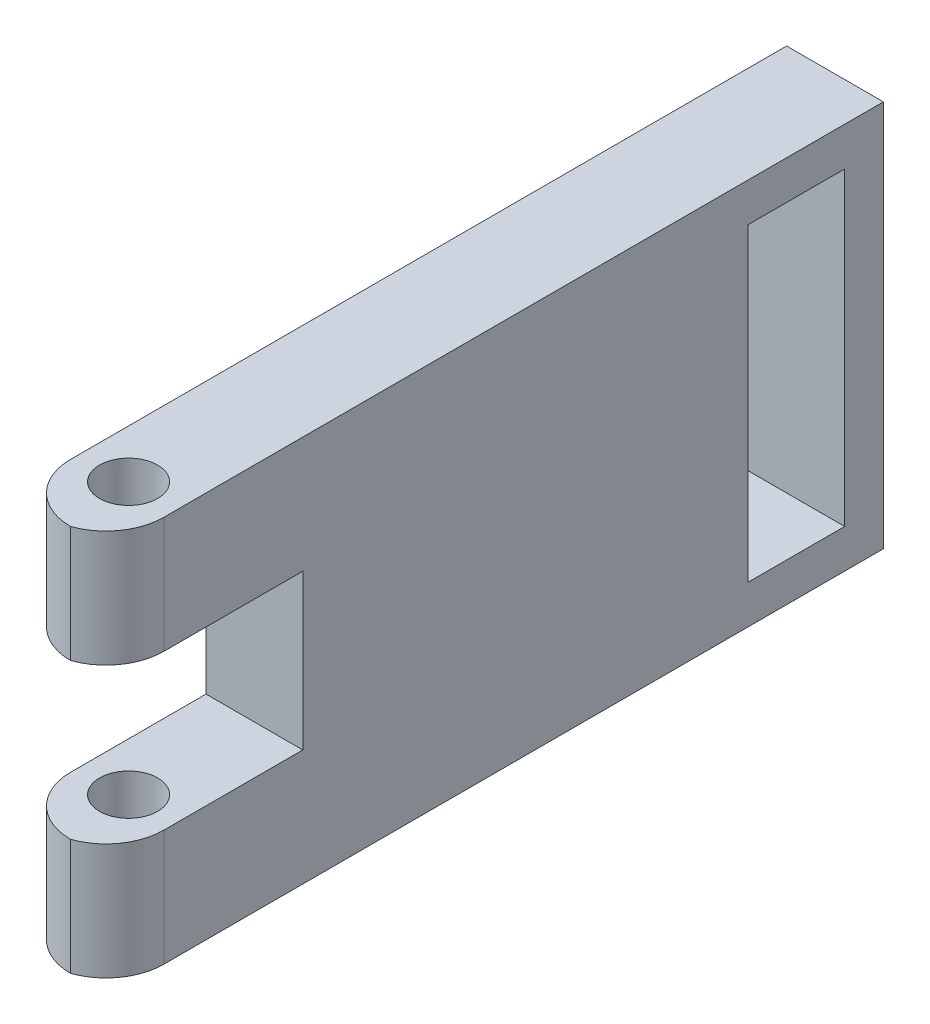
ISO-10303-21;
HEADER;
FILE_DESCRIPTION(('STEP AP214'),'2;1');
FILE_NAME('part.step','',(''),(''),'','','');
FILE_SCHEMA(('AUTOMOTIVE_DESIGN { 1 0 10303 214 1 1 1 1 }'));
ENDSEC;
DATA;
#1=APPLICATION_CONTEXT('core data for automotive mechanical design processes');
#2=APPLICATION_PROTOCOL_DEFINITION('international standard','automotive_design',2000,#1);
#3=PRODUCT_CONTEXT('',#1,'mechanical');
#4=PRODUCT('Part','Part','',(#3));
#5=PRODUCT_RELATED_PRODUCT_CATEGORY('part','',(#4));
#6=PRODUCT_DEFINITION_FORMATION('','',#4);
#7=PRODUCT_DEFINITION_CONTEXT('part definition',#1,'design');
#8=PRODUCT_DEFINITION('design','',#6,#7);
#9=PRODUCT_DEFINITION_SHAPE('','',#8);
#10=(LENGTH_UNIT() NAMED_UNIT(*) SI_UNIT(.MILLI.,.METRE.));
#11=(NAMED_UNIT(*) PLANE_ANGLE_UNIT() SI_UNIT($,.RADIAN.));
#12=(NAMED_UNIT(*) SI_UNIT($,.STERADIAN.) SOLID_ANGLE_UNIT());
#13=UNCERTAINTY_MEASURE_WITH_UNIT(LENGTH_MEASURE(1.E-05),#10,'distance_accuracy_value','');
#14=(GEOMETRIC_REPRESENTATION_CONTEXT(3) GLOBAL_UNCERTAINTY_ASSIGNED_CONTEXT((#13)) GLOBAL_UNIT_ASSIGNED_CONTEXT((#10,
#11,#12)) REPRESENTATION_CONTEXT('',''));
#15=CARTESIAN_POINT('',(0.,0.,0.));
#16=DIRECTION('',(0.,0.,1.));
#17=DIRECTION('',(1.,0.,0.));
#18=AXIS2_PLACEMENT_3D('',#15,#16,#17);
#19=CARTESIAN_POINT('',(5.,0.,0.));
#20=DIRECTION('',(0.,0.,-1.));
#21=DIRECTION('',(-1.,0.,0.));
#22=AXIS2_PLACEMENT_3D('',#19,#20,#21);
#23=PLANE('',#22);
#24=DIRECTION('',(1.,0.,0.));
#25=VECTOR('',#24,1.);
#26=CARTESIAN_POINT('',(0.,14.,0.));
#27=LINE('',#26,#25);
#28=CARTESIAN_POINT('',(0.,14.,0.));
#29=VERTEX_POINT('',#28);
#30=CARTESIAN_POINT('',(5.,14.,0.));
#31=VERTEX_POINT('',#30);
#32=EDGE_CURVE('E205',#29,#31,#27,.T.);
#33=ORIENTED_EDGE('',*,*,#32,.F.);
#34=DIRECTION('',(0.,-1.,0.));
#35=VECTOR('',#34,1.);
#36=CARTESIAN_POINT('',(0.,0.,0.));
#37=LINE('',#36,#35);
#38=CARTESIAN_POINT('',(0.,6.,0.));
#39=VERTEX_POINT('',#38);
#40=EDGE_CURVE('E225',#29,#39,#37,.T.);
#41=ORIENTED_EDGE('',*,*,#40,.T.);
#42=DIRECTION('',(-1.,0.,0.));
#43=VECTOR('',#42,1.);
#44=CARTESIAN_POINT('',(0.,6.,0.));
#45=LINE('',#44,#43);
#46=CARTESIAN_POINT('',(5.,6.,0.));
#47=VERTEX_POINT('',#46);
#48=EDGE_CURVE('E215',#47,#39,#45,.T.);
#49=ORIENTED_EDGE('',*,*,#48,.F.);
#50=DIRECTION('',(0.,-1.,0.));
#51=VECTOR('',#50,1.);
#52=CARTESIAN_POINT('',(5.,0.,0.));
#53=LINE('',#52,#51);
#54=EDGE_CURVE('E226',#31,#47,#53,.T.);
#55=ORIENTED_EDGE('',*,*,#54,.F.);
#56=EDGE_LOOP('',(#33,#41,#49,#55));
#57=FACE_BOUND('',#56,.T.);
#58=ADVANCED_FACE('F43',(#57),#23,.F.);
#59=CARTESIAN_POINT('',(5.,0.,0.));
#60=DIRECTION('',(0.,1.,0.));
#61=DIRECTION('',(0.,0.,1.));
#62=AXIS2_PLACEMENT_3D('',#59,#60,#61);
#63=PLANE('',#62);
#64=CARTESIAN_POINT('',(2.5,0.,6.5));
#65=DIRECTION('',(0.,1.,0.));
#66=DIRECTION('',(0.,0.,1.));
#67=AXIS2_PLACEMENT_3D('',#64,#65,#66);
#68=CIRCLE('',#67,1.5);
#69=CARTESIAN_POINT('',(2.5,0.,8.));
#70=VERTEX_POINT('',#69);
#71=EDGE_CURVE('E193',#70,#70,#68,.T.);
#72=ORIENTED_EDGE('',*,*,#71,.T.);
#73=EDGE_LOOP('',(#72));
#74=FACE_BOUND('',#73,.T.);
#75=DIRECTION('',(0.,0.,-1.));
#76=VECTOR('',#75,1.);
#77=CARTESIAN_POINT('',(5.,0.,0.));
#78=LINE('',#77,#76);
#79=CARTESIAN_POINT('',(5.,0.,7.17157287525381));
#80=VERTEX_POINT('',#79);
#81=CARTESIAN_POINT('',(5.,0.,-30.));
#82=VERTEX_POINT('',#81);
#83=EDGE_CURVE('E230',#80,#82,#78,.T.);
#84=ORIENTED_EDGE('',*,*,#83,.F.);
#85=CARTESIAN_POINT('',(2.,0.,7.17157287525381));
#86=DIRECTION('',(0.,1.,0.));
#87=DIRECTION('',(0.,0.,1.));
#88=AXIS2_PLACEMENT_3D('',#85,#86,#87);
#89=CIRCLE('',#88,3.);
#90=CARTESIAN_POINT('',(3.,0.,10.));
#91=VERTEX_POINT('',#90);
#92=EDGE_CURVE('E281',#80,#91,#89,.F.);
#93=ORIENTED_EDGE('',*,*,#92,.T.);
#94=CARTESIAN_POINT('',(3.,0.,7.));
#95=DIRECTION('',(0.,1.,0.));
#96=DIRECTION('',(0.,0.,1.));
#97=AXIS2_PLACEMENT_3D('',#94,#95,#96);
#98=CIRCLE('',#97,3.);
#99=CARTESIAN_POINT('',(0.,0.,7.));
#100=VERTEX_POINT('',#99);
#101=EDGE_CURVE('E265',#91,#100,#98,.F.);
#102=ORIENTED_EDGE('',*,*,#101,.T.);
#103=DIRECTION('',(0.,0.,-1.));
#104=VECTOR('',#103,1.);
#105=CARTESIAN_POINT('',(0.,0.,0.));
#106=LINE('',#105,#104);
#107=CARTESIAN_POINT('',(0.,0.,-30.));
#108=VERTEX_POINT('',#107);
#109=EDGE_CURVE('E245',#100,#108,#106,.T.);
#110=ORIENTED_EDGE('',*,*,#109,.T.);
#111=DIRECTION('',(-1.,0.,0.));
#112=VECTOR('',#111,1.);
#113=CARTESIAN_POINT('',(5.,0.,-30.));
#114=LINE('',#113,#112);
#115=EDGE_CURVE('E257',#82,#108,#114,.T.);
#116=ORIENTED_EDGE('',*,*,#115,.F.);
#117=EDGE_LOOP('',(#84,#93,#102,#110,#116));
#118=FACE_BOUND('',#117,.T.);
#119=ADVANCED_FACE('F343',(#74,#118),#63,.F.);
#120=CARTESIAN_POINT('',(5.,0.,-30.));
#121=DIRECTION('',(0.,0.,1.));
#122=DIRECTION('',(1.,0.,0.));
#123=AXIS2_PLACEMENT_3D('',#120,#121,#122);
#124=PLANE('',#123);
#125=DIRECTION('',(0.,1.,0.));
#126=VECTOR('',#125,1.);
#127=CARTESIAN_POINT('',(0.,0.,-30.));
#128=LINE('',#127,#126);
#129=CARTESIAN_POINT('',(0.,20.,-30.));
#130=VERTEX_POINT('',#129);
#131=EDGE_CURVE('E248',#108,#130,#128,.T.);
#132=ORIENTED_EDGE('',*,*,#131,.T.);
#133=DIRECTION('',(-1.,0.,0.));
#134=VECTOR('',#133,1.);
#135=CARTESIAN_POINT('',(5.,20.,-30.));
#136=LINE('',#135,#134);
#137=CARTESIAN_POINT('',(5.,20.,-30.));
#138=VERTEX_POINT('',#137);
#139=EDGE_CURVE('E241',#138,#130,#136,.T.);
#140=ORIENTED_EDGE('',*,*,#139,.F.);
#141=DIRECTION('',(0.,1.,0.));
#142=VECTOR('',#141,1.);
#143=CARTESIAN_POINT('',(5.,0.,-30.));
#144=LINE('',#143,#142);
#145=EDGE_CURVE('E234',#82,#138,#144,.T.);
#146=ORIENTED_EDGE('',*,*,#145,.F.);
#147=ORIENTED_EDGE('',*,*,#115,.T.);
#148=EDGE_LOOP('',(#132,#140,#146,#147));
#149=FACE_BOUND('',#148,.T.);
#150=ADVANCED_FACE('F325',(#149),#124,.F.);
#151=CARTESIAN_POINT('',(5.,20.,0.));
#152=DIRECTION('',(0.,-1.,0.));
#153=DIRECTION('',(0.,0.,-1.));
#154=AXIS2_PLACEMENT_3D('',#151,#152,#153);
#155=PLANE('',#154);
#156=CARTESIAN_POINT('',(2.5,20.,6.5));
#157=DIRECTION('',(0.,-1.,0.));
#158=DIRECTION('',(0.,0.,-1.));
#159=AXIS2_PLACEMENT_3D('',#156,#157,#158);
#160=CIRCLE('',#159,1.5);
#161=CARTESIAN_POINT('',(2.5,20.,5.));
#162=VERTEX_POINT('',#161);
#163=EDGE_CURVE('E201',#162,#162,#160,.T.);
#164=ORIENTED_EDGE('',*,*,#163,.T.);
#165=EDGE_LOOP('',(#164));
#166=FACE_BOUND('',#165,.T.);
#167=CARTESIAN_POINT('',(3.,20.,7.));
#168=DIRECTION('',(0.,-1.,0.));
#169=DIRECTION('',(0.,0.,-1.));
#170=AXIS2_PLACEMENT_3D('',#167,#168,#169);
#171=CIRCLE('',#170,3.);
#172=CARTESIAN_POINT('',(0.,20.,7.));
#173=VERTEX_POINT('',#172);
#174=CARTESIAN_POINT('',(3.,20.,10.));
#175=VERTEX_POINT('',#174);
#176=EDGE_CURVE('E294',#173,#175,#171,.F.);
#177=ORIENTED_EDGE('',*,*,#176,.T.);
#178=CARTESIAN_POINT('',(2.,20.,7.17157287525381));
#179=DIRECTION('',(0.,-1.,0.));
#180=DIRECTION('',(0.,0.,-1.));
#181=AXIS2_PLACEMENT_3D('',#178,#179,#180);
#182=CIRCLE('',#181,3.);
#183=CARTESIAN_POINT('',(5.,20.,7.17157287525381));
#184=VERTEX_POINT('',#183);
#185=EDGE_CURVE('E11',#175,#184,#182,.F.);
#186=ORIENTED_EDGE('',*,*,#185,.T.);
#187=DIRECTION('',(0.,0.,1.));
#188=VECTOR('',#187,1.);
#189=CARTESIAN_POINT('',(5.,20.,0.));
#190=LINE('',#189,#188);
#191=EDGE_CURVE('E237',#138,#184,#190,.T.);
#192=ORIENTED_EDGE('',*,*,#191,.F.);
#193=ORIENTED_EDGE('',*,*,#139,.T.);
#194=DIRECTION('',(0.,0.,1.));
#195=VECTOR('',#194,1.);
#196=CARTESIAN_POINT('',(0.,20.,0.));
#197=LINE('',#196,#195);
#198=EDGE_CURVE('E231',#130,#173,#197,.T.);
#199=ORIENTED_EDGE('',*,*,#198,.T.);
#200=EDGE_LOOP('',(#177,#186,#192,#193,#199));
#201=FACE_BOUND('',#200,.T.);
#202=ADVANCED_FACE('F317',(#166,#201),#155,.F.);
#203=CARTESIAN_POINT('',(5.,0.,0.));
#204=DIRECTION('',(-1.,0.,0.));
#205=DIRECTION('',(0.,0.,1.));
#206=AXIS2_PLACEMENT_3D('',#203,#204,#205);
#207=PLANE('',#206);
#208=DIRECTION('',(0.,1.,0.));
#209=VECTOR('',#208,1.);
#210=CARTESIAN_POINT('',(5.,0.,-28.));
#211=LINE('',#210,#209);
#212=CARTESIAN_POINT('',(5.,2.,-28.));
#213=VERTEX_POINT('',#212);
#214=CARTESIAN_POINT('',(5.,18.,-28.));
#215=VERTEX_POINT('',#214);
#216=EDGE_CURVE('E175',#213,#215,#211,.T.);
#217=ORIENTED_EDGE('',*,*,#216,.F.);
#218=DIRECTION('',(0.,0.,1.));
#219=VECTOR('',#218,1.);
#220=CARTESIAN_POINT('',(5.,2.00000000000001,0.));
#221=LINE('',#220,#219);
#222=CARTESIAN_POINT('',(5.,2.,-23.));
#223=VERTEX_POINT('',#222);
#224=EDGE_CURVE('E157',#213,#223,#221,.T.);
#225=ORIENTED_EDGE('',*,*,#224,.T.);
#226=DIRECTION('',(0.,1.,0.));
#227=VECTOR('',#226,1.);
#228=CARTESIAN_POINT('',(5.,0.,-23.));
#229=LINE('',#228,#227);
#230=CARTESIAN_POINT('',(5.,18.,-23.));
#231=VERTEX_POINT('',#230);
#232=EDGE_CURVE('E187',#223,#231,#229,.T.);
#233=ORIENTED_EDGE('',*,*,#232,.T.);
#234=DIRECTION('',(0.,0.,1.));
#235=VECTOR('',#234,1.);
#236=CARTESIAN_POINT('',(5.,18.,0.));
#237=LINE('',#236,#235);
#238=EDGE_CURVE('E184',#215,#231,#237,.T.);
#239=ORIENTED_EDGE('',*,*,#238,.F.);
#240=EDGE_LOOP('',(#217,#225,#233,#239));
#241=FACE_BOUND('',#240,.T.);
#242=ORIENTED_EDGE('',*,*,#191,.T.);
#243=DIRECTION('',(0.,-1.,0.));
#244=VECTOR('',#243,1.);
#245=CARTESIAN_POINT('',(5.,0.,7.17157287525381));
#246=LINE('',#245,#244);
#247=CARTESIAN_POINT('',(5.,14.,7.17157287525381));
#248=VERTEX_POINT('',#247);
#249=EDGE_CURVE('E297',#184,#248,#246,.T.);
#250=ORIENTED_EDGE('',*,*,#249,.T.);
#251=DIRECTION('',(0.,0.,-1.));
#252=VECTOR('',#251,1.);
#253=CARTESIAN_POINT('',(5.,14.,10.));
#254=LINE('',#253,#252);
#255=EDGE_CURVE('E212',#248,#31,#254,.T.);
#256=ORIENTED_EDGE('',*,*,#255,.T.);
#257=ORIENTED_EDGE('',*,*,#54,.T.);
#258=DIRECTION('',(0.,0.,-1.));
#259=VECTOR('',#258,1.);
#260=CARTESIAN_POINT('',(5.,6.,10.));
#261=LINE('',#260,#259);
#262=CARTESIAN_POINT('',(5.,6.,7.17157287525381));
#263=VERTEX_POINT('',#262);
#264=EDGE_CURVE('E222',#263,#47,#261,.T.);
#265=ORIENTED_EDGE('',*,*,#264,.F.);
#266=DIRECTION('',(0.,-1.,0.));
#267=VECTOR('',#266,1.);
#268=CARTESIAN_POINT('',(5.,0.,7.17157287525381));
#269=LINE('',#268,#267);
#270=EDGE_CURVE('E278',#263,#80,#269,.T.);
#271=ORIENTED_EDGE('',*,*,#270,.T.);
#272=ORIENTED_EDGE('',*,*,#83,.T.);
#273=ORIENTED_EDGE('',*,*,#145,.T.);
#274=EDGE_LOOP('',(#242,#250,#256,#257,#265,#271,#272,#273));
#275=FACE_BOUND('',#274,.T.);
#276=ADVANCED_FACE('F319',(#241,#275),#207,.F.);
#277=CARTESIAN_POINT('',(0.,0.,0.));
#278=DIRECTION('',(-1.,0.,0.));
#279=DIRECTION('',(0.,0.,1.));
#280=AXIS2_PLACEMENT_3D('',#277,#278,#279);
#281=PLANE('',#280);
#282=DIRECTION('',(0.,0.,-1.));
#283=VECTOR('',#282,1.);
#284=CARTESIAN_POINT('',(0.,2.,-23.));
#285=LINE('',#284,#283);
#286=CARTESIAN_POINT('',(0.,2.,-23.));
#287=VERTEX_POINT('',#286);
#288=CARTESIAN_POINT('',(0.,2.,-28.));
#289=VERTEX_POINT('',#288);
#290=EDGE_CURVE('E149',#287,#289,#285,.T.);
#291=ORIENTED_EDGE('',*,*,#290,.T.);
#292=DIRECTION('',(0.,-1.,0.));
#293=VECTOR('',#292,1.);
#294=CARTESIAN_POINT('',(0.,18.,-28.));
#295=LINE('',#294,#293);
#296=CARTESIAN_POINT('',(0.,18.,-28.));
#297=VERTEX_POINT('',#296);
#298=EDGE_CURVE('E142',#297,#289,#295,.T.);
#299=ORIENTED_EDGE('',*,*,#298,.F.);
#300=DIRECTION('',(0.,0.,-1.));
#301=VECTOR('',#300,1.);
#302=CARTESIAN_POINT('',(0.,18.,-23.));
#303=LINE('',#302,#301);
#304=CARTESIAN_POINT('',(0.,18.,-23.));
#305=VERTEX_POINT('',#304);
#306=EDGE_CURVE('E148',#305,#297,#303,.T.);
#307=ORIENTED_EDGE('',*,*,#306,.F.);
#308=DIRECTION('',(0.,-1.,0.));
#309=VECTOR('',#308,1.);
#310=CARTESIAN_POINT('',(0.,18.,-23.));
#311=LINE('',#310,#309);
#312=EDGE_CURVE('E160',#305,#287,#311,.T.);
#313=ORIENTED_EDGE('',*,*,#312,.T.);
#314=EDGE_LOOP('',(#291,#299,#307,#313));
#315=FACE_BOUND('',#314,.T.);
#316=DIRECTION('',(0.,0.,-1.));
#317=VECTOR('',#316,1.);
#318=CARTESIAN_POINT('',(0.,14.,10.));
#319=LINE('',#318,#317);
#320=CARTESIAN_POINT('',(0.,14.,7.));
#321=VERTEX_POINT('',#320);
#322=EDGE_CURVE('E209',#321,#29,#319,.T.);
#323=ORIENTED_EDGE('',*,*,#322,.F.);
#324=DIRECTION('',(0.,-1.,0.));
#325=VECTOR('',#324,1.);
#326=CARTESIAN_POINT('',(0.,20.,7.));
#327=LINE('',#326,#325);
#328=EDGE_CURVE('E291',#321,#173,#327,.F.);
#329=ORIENTED_EDGE('',*,*,#328,.T.);
#330=ORIENTED_EDGE('',*,*,#198,.F.);
#331=ORIENTED_EDGE('',*,*,#131,.F.);
#332=ORIENTED_EDGE('',*,*,#109,.F.);
#333=DIRECTION('',(0.,-1.,0.));
#334=VECTOR('',#333,1.);
#335=CARTESIAN_POINT('',(0.,6.,7.));
#336=LINE('',#335,#334);
#337=CARTESIAN_POINT('',(0.,6.,7.));
#338=VERTEX_POINT('',#337);
#339=EDGE_CURVE('E268',#100,#338,#336,.F.);
#340=ORIENTED_EDGE('',*,*,#339,.T.);
#341=DIRECTION('',(0.,0.,-1.));
#342=VECTOR('',#341,1.);
#343=CARTESIAN_POINT('',(0.,6.,10.));
#344=LINE('',#343,#342);
#345=EDGE_CURVE('E219',#338,#39,#344,.T.);
#346=ORIENTED_EDGE('',*,*,#345,.T.);
#347=ORIENTED_EDGE('',*,*,#40,.F.);
#348=EDGE_LOOP('',(#323,#329,#330,#331,#332,#340,#346,#347));
#349=FACE_BOUND('',#348,.T.);
#350=ADVANCED_FACE('F162',(#315,#349),#281,.T.);
#351=CARTESIAN_POINT('',(0.,6.,10.));
#352=DIRECTION('',(0.,-1.,0.));
#353=DIRECTION('',(0.,0.,-1.));
#354=AXIS2_PLACEMENT_3D('',#351,#352,#353);
#355=PLANE('',#354);
#356=CARTESIAN_POINT('',(2.5,6.,6.5));
#357=DIRECTION('',(0.,-1.,0.));
#358=DIRECTION('',(0.,0.,-1.));
#359=AXIS2_PLACEMENT_3D('',#356,#357,#358);
#360=CIRCLE('',#359,1.5);
#361=CARTESIAN_POINT('',(2.5,6.,5.));
#362=VERTEX_POINT('',#361);
#363=EDGE_CURVE('E197',#362,#362,#360,.T.);
#364=ORIENTED_EDGE('',*,*,#363,.T.);
#365=EDGE_LOOP('',(#364));
#366=FACE_BOUND('',#365,.T.);
#367=CARTESIAN_POINT('',(3.,6.,7.));
#368=DIRECTION('',(0.,-1.,0.));
#369=DIRECTION('',(0.,0.,-1.));
#370=AXIS2_PLACEMENT_3D('',#367,#368,#369);
#371=CIRCLE('',#370,3.);
#372=CARTESIAN_POINT('',(3.,6.,10.));
#373=VERTEX_POINT('',#372);
#374=EDGE_CURVE('E271',#338,#373,#371,.F.);
#375=ORIENTED_EDGE('',*,*,#374,.T.);
#376=CARTESIAN_POINT('',(2.,6.,7.17157287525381));
#377=DIRECTION('',(0.,-1.,0.));
#378=DIRECTION('',(0.,0.,-1.));
#379=AXIS2_PLACEMENT_3D('',#376,#377,#378);
#380=CIRCLE('',#379,3.);
#381=EDGE_CURVE('E275',#373,#263,#380,.F.);
#382=ORIENTED_EDGE('',*,*,#381,.T.);
#383=ORIENTED_EDGE('',*,*,#264,.T.);
#384=ORIENTED_EDGE('',*,*,#48,.T.);
#385=ORIENTED_EDGE('',*,*,#345,.F.);
#386=EDGE_LOOP('',(#375,#382,#383,#384,#385));
#387=FACE_BOUND('',#386,.T.);
#388=ADVANCED_FACE('F349',(#366,#387),#355,.F.);
#389=CARTESIAN_POINT('',(0.,14.,10.));
#390=DIRECTION('',(0.,1.,0.));
#391=DIRECTION('',(0.,0.,1.));
#392=AXIS2_PLACEMENT_3D('',#389,#390,#391);
#393=PLANE('',#392);
#394=CARTESIAN_POINT('',(2.5,14.,6.5));
#395=DIRECTION('',(0.,1.,0.));
#396=DIRECTION('',(0.,0.,1.));
#397=AXIS2_PLACEMENT_3D('',#394,#395,#396);
#398=CIRCLE('',#397,1.5);
#399=CARTESIAN_POINT('',(2.5,14.,8.));
#400=VERTEX_POINT('',#399);
#401=EDGE_CURVE('E47',#400,#400,#398,.T.);
#402=ORIENTED_EDGE('',*,*,#401,.T.);
#403=EDGE_LOOP('',(#402));
#404=FACE_BOUND('',#403,.T.);
#405=ORIENTED_EDGE('',*,*,#255,.F.);
#406=CARTESIAN_POINT('',(2.,14.,7.17157287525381));
#407=DIRECTION('',(0.,1.,0.));
#408=DIRECTION('',(0.,0.,1.));
#409=AXIS2_PLACEMENT_3D('',#406,#407,#408);
#410=CIRCLE('',#409,3.);
#411=CARTESIAN_POINT('',(3.,14.,10.));
#412=VERTEX_POINT('',#411);
#413=EDGE_CURVE('E53',#248,#412,#410,.F.);
#414=ORIENTED_EDGE('',*,*,#413,.T.);
#415=CARTESIAN_POINT('',(3.,14.,7.));
#416=DIRECTION('',(0.,1.,0.));
#417=DIRECTION('',(0.,0.,1.));
#418=AXIS2_PLACEMENT_3D('',#415,#416,#417);
#419=CIRCLE('',#418,3.);
#420=EDGE_CURVE('E288',#412,#321,#419,.F.);
#421=ORIENTED_EDGE('',*,*,#420,.T.);
#422=ORIENTED_EDGE('',*,*,#322,.T.);
#423=ORIENTED_EDGE('',*,*,#32,.T.);
#424=EDGE_LOOP('',(#405,#414,#421,#422,#423));
#425=FACE_BOUND('',#424,.T.);
#426=ADVANCED_FACE('F305',(#404,#425),#393,.F.);
#427=CARTESIAN_POINT('',(3.,0.,7.));
#428=DIRECTION('',(0.,1.,0.));
#429=DIRECTION('',(0.,0.,1.));
#430=AXIS2_PLACEMENT_3D('',#427,#428,#429);
#431=CYLINDRICAL_SURFACE('',#430,3.);
#432=ORIENTED_EDGE('',*,*,#374,.F.);
#433=ORIENTED_EDGE('',*,*,#339,.F.);
#434=ORIENTED_EDGE('',*,*,#101,.F.);
#435=DIRECTION('',(0.,-1.,0.));
#436=VECTOR('',#435,1.);
#437=CARTESIAN_POINT('',(3.,0.,10.));
#438=LINE('',#437,#436);
#439=EDGE_CURVE('E261',#373,#91,#438,.T.);
#440=ORIENTED_EDGE('',*,*,#439,.F.);
#441=EDGE_LOOP('',(#432,#433,#434,#440));
#442=FACE_BOUND('',#441,.T.);
#443=ADVANCED_FACE('F347',(#442),#431,.T.);
#444=CARTESIAN_POINT('',(2.,0.,7.17157287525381));
#445=DIRECTION('',(0.,-1.,0.));
#446=DIRECTION('',(0.,0.,-1.));
#447=AXIS2_PLACEMENT_3D('',#444,#445,#446);
#448=CYLINDRICAL_SURFACE('',#447,3.);
#449=ORIENTED_EDGE('',*,*,#92,.F.);
#450=ORIENTED_EDGE('',*,*,#270,.F.);
#451=ORIENTED_EDGE('',*,*,#381,.F.);
#452=ORIENTED_EDGE('',*,*,#439,.T.);
#453=EDGE_LOOP('',(#449,#450,#451,#452));
#454=FACE_BOUND('',#453,.T.);
#455=ADVANCED_FACE('F339',(#454),#448,.T.);
#456=CARTESIAN_POINT('',(3.,0.,7.));
#457=DIRECTION('',(0.,1.,0.));
#458=DIRECTION('',(0.,0.,1.));
#459=AXIS2_PLACEMENT_3D('',#456,#457,#458);
#460=CYLINDRICAL_SURFACE('',#459,3.);
#461=ORIENTED_EDGE('',*,*,#176,.F.);
#462=ORIENTED_EDGE('',*,*,#328,.F.);
#463=ORIENTED_EDGE('',*,*,#420,.F.);
#464=DIRECTION('',(0.,-1.,0.));
#465=VECTOR('',#464,1.);
#466=CARTESIAN_POINT('',(3.,14.,10.));
#467=LINE('',#466,#465);
#468=EDGE_CURVE('E284',#175,#412,#467,.T.);
#469=ORIENTED_EDGE('',*,*,#468,.F.);
#470=EDGE_LOOP('',(#461,#462,#463,#469));
#471=FACE_BOUND('',#470,.T.);
#472=ADVANCED_FACE('F313',(#471),#460,.T.);
#473=CARTESIAN_POINT('',(2.,0.,7.17157287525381));
#474=DIRECTION('',(0.,-1.,0.));
#475=DIRECTION('',(0.,0.,-1.));
#476=AXIS2_PLACEMENT_3D('',#473,#474,#475);
#477=CYLINDRICAL_SURFACE('',#476,3.);
#478=ORIENTED_EDGE('',*,*,#185,.F.);
#479=ORIENTED_EDGE('',*,*,#468,.T.);
#480=ORIENTED_EDGE('',*,*,#413,.F.);
#481=ORIENTED_EDGE('',*,*,#249,.F.);
#482=EDGE_LOOP('',(#478,#479,#480,#481));
#483=FACE_BOUND('',#482,.T.);
#484=ADVANCED_FACE('F45',(#483),#477,.T.);
#485=CARTESIAN_POINT('',(2.5,0.,6.5));
#486=DIRECTION('',(0.,1.,0.));
#487=DIRECTION('',(0.,0.,1.));
#488=AXIS2_PLACEMENT_3D('',#485,#486,#487);
#489=CYLINDRICAL_SURFACE('',#488,1.5);
#490=ORIENTED_EDGE('',*,*,#401,.F.);
#491=EDGE_LOOP('',(#490));
#492=FACE_BOUND('',#491,.T.);
#493=ORIENTED_EDGE('',*,*,#163,.F.);
#494=EDGE_LOOP('',(#493));
#495=FACE_BOUND('',#494,.T.);
#496=ADVANCED_FACE('F379',(#492,#495),#489,.F.);
#497=ORIENTED_EDGE('',*,*,#71,.F.);
#498=EDGE_LOOP('',(#497));
#499=FACE_BOUND('',#498,.T.);
#500=ORIENTED_EDGE('',*,*,#363,.F.);
#501=EDGE_LOOP('',(#500));
#502=FACE_BOUND('',#501,.T.);
#503=ADVANCED_FACE('F383',(#499,#502),#489,.F.);
#504=CARTESIAN_POINT('',(0.,2.,-23.));
#505=DIRECTION('',(0.,-1.,0.));
#506=DIRECTION('',(0.,0.,-1.));
#507=AXIS2_PLACEMENT_3D('',#504,#505,#506);
#508=PLANE('',#507);
#509=DIRECTION('',(1.,0.,0.));
#510=VECTOR('',#509,1.);
#511=CARTESIAN_POINT('',(0.,2.,-28.));
#512=LINE('',#511,#510);
#513=EDGE_CURVE('E60',#289,#213,#512,.T.);
#514=ORIENTED_EDGE('',*,*,#513,.F.);
#515=ORIENTED_EDGE('',*,*,#290,.F.);
#516=DIRECTION('',(1.,0.,0.));
#517=VECTOR('',#516,1.);
#518=CARTESIAN_POINT('',(0.,2.,-23.));
#519=LINE('',#518,#517);
#520=EDGE_CURVE('E172',#287,#223,#519,.T.);
#521=ORIENTED_EDGE('',*,*,#520,.T.);
#522=ORIENTED_EDGE('',*,*,#224,.F.);
#523=EDGE_LOOP('',(#514,#515,#521,#522));
#524=FACE_BOUND('',#523,.T.);
#525=ADVANCED_FACE('F153',(#524),#508,.F.);
#526=CARTESIAN_POINT('',(0.,18.,-23.));
#527=DIRECTION('',(0.,0.,1.));
#528=DIRECTION('',(0.,-1.,0.));
#529=AXIS2_PLACEMENT_3D('',#526,#527,#528);
#530=PLANE('',#529);
#531=ORIENTED_EDGE('',*,*,#520,.F.);
#532=ORIENTED_EDGE('',*,*,#312,.F.);
#533=DIRECTION('',(1.,0.,0.));
#534=VECTOR('',#533,1.);
#535=CARTESIAN_POINT('',(0.,18.,-23.));
#536=LINE('',#535,#534);
#537=EDGE_CURVE('E176',#305,#231,#536,.T.);
#538=ORIENTED_EDGE('',*,*,#537,.T.);
#539=ORIENTED_EDGE('',*,*,#232,.F.);
#540=EDGE_LOOP('',(#531,#532,#538,#539));
#541=FACE_BOUND('',#540,.T.);
#542=ADVANCED_FACE('F395',(#541),#530,.F.);
#543=CARTESIAN_POINT('',(0.,18.,-23.));
#544=DIRECTION('',(0.,-1.,0.));
#545=DIRECTION('',(0.,0.,-1.));
#546=AXIS2_PLACEMENT_3D('',#543,#544,#545);
#547=PLANE('',#546);
#548=ORIENTED_EDGE('',*,*,#238,.T.);
#549=ORIENTED_EDGE('',*,*,#537,.F.);
#550=ORIENTED_EDGE('',*,*,#306,.T.);
#551=DIRECTION('',(1.,0.,0.));
#552=VECTOR('',#551,1.);
#553=CARTESIAN_POINT('',(0.,18.,-28.));
#554=LINE('',#553,#552);
#555=EDGE_CURVE('E65',#297,#215,#554,.T.);
#556=ORIENTED_EDGE('',*,*,#555,.T.);
#557=EDGE_LOOP('',(#548,#549,#550,#556));
#558=FACE_BOUND('',#557,.T.);
#559=ADVANCED_FACE('F398',(#558),#547,.T.);
#560=CARTESIAN_POINT('',(0.,18.,-28.));
#561=DIRECTION('',(0.,0.,1.));
#562=DIRECTION('',(1.,0.,0.));
#563=AXIS2_PLACEMENT_3D('',#560,#561,#562);
#564=PLANE('',#563);
#565=ORIENTED_EDGE('',*,*,#216,.T.);
#566=ORIENTED_EDGE('',*,*,#555,.F.);
#567=ORIENTED_EDGE('',*,*,#298,.T.);
#568=ORIENTED_EDGE('',*,*,#513,.T.);
#569=EDGE_LOOP('',(#565,#566,#567,#568));
#570=FACE_BOUND('',#569,.T.);
#571=ADVANCED_FACE('F143',(#570),#564,.T.);
#572=CLOSED_SHELL('',(#58,#119,#150,#202,#276,#350,#388,#426,#443,#455,#472,#484,#496,#503,#525,
#542,#559,#571));
#573=MANIFOLD_SOLID_BREP('B2',#572);
#574=ADVANCED_BREP_SHAPE_REPRESENTATION('',(#18,#573),#14);
#575=SHAPE_DEFINITION_REPRESENTATION(#9,#574);
ENDSEC;
END-ISO-10303-21;
